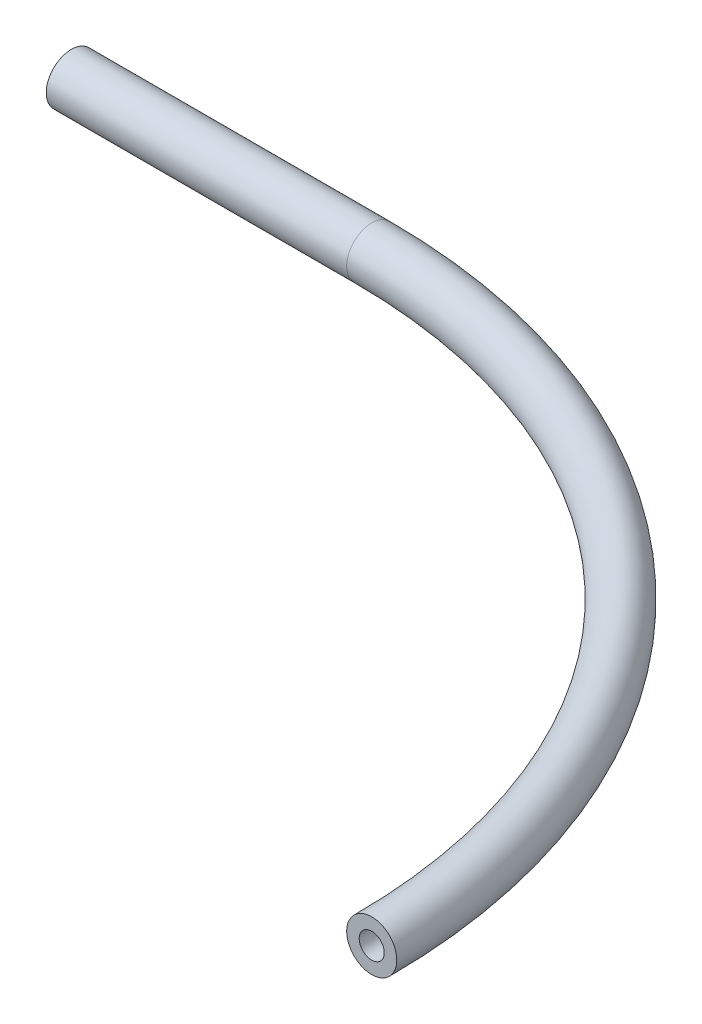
ISO-10303-21;
HEADER;
FILE_DESCRIPTION(('STEP AP214'),'2;1');
FILE_NAME('part.step','',(''),(''),'','','');
FILE_SCHEMA(('AUTOMOTIVE_DESIGN { 1 0 10303 214 1 1 1 1 }'));
ENDSEC;
DATA;
#1=APPLICATION_CONTEXT('core data for automotive mechanical design processes');
#2=APPLICATION_PROTOCOL_DEFINITION('international standard','automotive_design',2000,#1);
#3=PRODUCT_CONTEXT('',#1,'mechanical');
#4=PRODUCT('Part','Part','',(#3));
#5=PRODUCT_RELATED_PRODUCT_CATEGORY('part','',(#4));
#6=PRODUCT_DEFINITION_FORMATION('','',#4);
#7=PRODUCT_DEFINITION_CONTEXT('part definition',#1,'design');
#8=PRODUCT_DEFINITION('design','',#6,#7);
#9=PRODUCT_DEFINITION_SHAPE('','',#8);
#10=(LENGTH_UNIT() NAMED_UNIT(*) SI_UNIT(.MILLI.,.METRE.));
#11=(NAMED_UNIT(*) PLANE_ANGLE_UNIT() SI_UNIT($,.RADIAN.));
#12=(NAMED_UNIT(*) SI_UNIT($,.STERADIAN.) SOLID_ANGLE_UNIT());
#13=UNCERTAINTY_MEASURE_WITH_UNIT(LENGTH_MEASURE(1.E-05),#10,'distance_accuracy_value','');
#14=(GEOMETRIC_REPRESENTATION_CONTEXT(3) GLOBAL_UNCERTAINTY_ASSIGNED_CONTEXT((#13)) GLOBAL_UNIT_ASSIGNED_CONTEXT((#10,
#11,#12)) REPRESENTATION_CONTEXT('',''));
#15=CARTESIAN_POINT('',(0.,0.,0.));
#16=DIRECTION('',(0.,0.,1.));
#17=DIRECTION('',(1.,0.,0.));
#18=AXIS2_PLACEMENT_3D('',#15,#16,#17);
#19=CARTESIAN_POINT('',(19.05,0.,38.1));
#20=DIRECTION('',(0.,-1.,0.));
#21=DIRECTION('',(0.,0.,-1.));
#22=AXIS2_PLACEMENT_3D('',#19,#20,#21);
#23=TOROIDAL_SURFACE('',#22,38.1,1.5875);
#24=CARTESIAN_POINT('',(19.05,0.,0.));
#25=DIRECTION('',(1.,0.,0.));
#26=DIRECTION('',(0.,0.,-1.));
#27=AXIS2_PLACEMENT_3D('',#24,#25,#26);
#28=CIRCLE('',#27,1.5875);
#29=CARTESIAN_POINT('',(19.05,0.,-1.58749999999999));
#30=VERTEX_POINT('',#29);
#31=EDGE_CURVE('E40',#30,#30,#28,.T.);
#32=CARTESIAN_POINT('',(57.15,0.,38.1));
#33=DIRECTION('',(0.,0.,1.));
#34=DIRECTION('',(1.,0.,0.));
#35=AXIS2_PLACEMENT_3D('',#32,#33,#34);
#36=CIRCLE('',#35,1.5875);
#37=CARTESIAN_POINT('',(58.7375,0.,38.1));
#38=VERTEX_POINT('',#37);
#39=EDGE_CURVE('E10',#38,#38,#36,.T.);
#40=CARTESIAN_POINT('',(19.05,0.,38.1));
#41=DIRECTION('',(0.,-1.,0.));
#42=DIRECTION('',(0.,0.,-1.));
#43=AXIS2_PLACEMENT_3D('',#40,#41,#42);
#44=CIRCLE('',#43,39.6875);
#45=EDGE_CURVE('',#30,#38,#44,.T.);
#46=ORIENTED_EDGE('',*,*,#31,.T.);
#47=ORIENTED_EDGE('',*,*,#39,.F.);
#48=ORIENTED_EDGE('',*,*,#45,.T.);
#49=ORIENTED_EDGE('',*,*,#45,.F.);
#50=EDGE_LOOP('',(#46,#48,#47,#49));
#51=FACE_BOUND('',#50,.T.);
#52=ADVANCED_FACE('F30',(#51),#23,.T.);
#53=CARTESIAN_POINT('',(19.05,0.,38.1));
#54=DIRECTION('',(0.,-1.,0.));
#55=DIRECTION('',(0.,0.,-1.));
#56=AXIS2_PLACEMENT_3D('',#53,#54,#55);
#57=TOROIDAL_SURFACE('',#56,38.1,0.79375);
#58=CARTESIAN_POINT('',(19.05,0.,0.));
#59=DIRECTION('',(1.,0.,0.));
#60=DIRECTION('',(0.,0.,-1.));
#61=AXIS2_PLACEMENT_3D('',#58,#59,#60);
#62=CIRCLE('',#61,0.79375);
#63=CARTESIAN_POINT('',(19.05,0.,-0.793749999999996));
#64=VERTEX_POINT('',#63);
#65=EDGE_CURVE('E44',#64,#64,#62,.T.);
#66=CARTESIAN_POINT('',(57.15,0.,38.1));
#67=DIRECTION('',(0.,0.,1.));
#68=DIRECTION('',(1.,0.,0.));
#69=AXIS2_PLACEMENT_3D('',#66,#67,#68);
#70=CIRCLE('',#69,0.79375);
#71=CARTESIAN_POINT('',(57.94375,0.,38.1));
#72=VERTEX_POINT('',#71);
#73=EDGE_CURVE('E36',#72,#72,#70,.T.);
#74=CARTESIAN_POINT('',(19.05,0.,38.1));
#75=DIRECTION('',(0.,-1.,0.));
#76=DIRECTION('',(0.,0.,-1.));
#77=AXIS2_PLACEMENT_3D('',#74,#75,#76);
#78=CIRCLE('',#77,38.89375);
#79=EDGE_CURVE('',#64,#72,#78,.T.);
#80=ORIENTED_EDGE('',*,*,#65,.F.);
#81=ORIENTED_EDGE('',*,*,#73,.T.);
#82=ORIENTED_EDGE('',*,*,#79,.T.);
#83=ORIENTED_EDGE('',*,*,#79,.F.);
#84=EDGE_LOOP('',(#80,#82,#81,#83));
#85=FACE_BOUND('',#84,.T.);
#86=ADVANCED_FACE('F59',(#85),#57,.F.);
#87=CARTESIAN_POINT('',(19.05,0.,0.));
#88=DIRECTION('',(-1.,0.,0.));
#89=DIRECTION('',(0.,0.,1.));
#90=AXIS2_PLACEMENT_3D('',#87,#88,#89);
#91=CYLINDRICAL_SURFACE('',#90,0.79375);
#92=ORIENTED_EDGE('',*,*,#65,.T.);
#93=EDGE_LOOP('',(#92));
#94=FACE_BOUND('',#93,.T.);
#95=CARTESIAN_POINT('',(0.,0.,0.));
#96=DIRECTION('',(1.,0.,0.));
#97=DIRECTION('',(0.,0.,-1.));
#98=AXIS2_PLACEMENT_3D('',#95,#96,#97);
#99=CIRCLE('',#98,0.79375);
#100=CARTESIAN_POINT('',(0.,0.,-0.79375));
#101=VERTEX_POINT('',#100);
#102=EDGE_CURVE('E50',#101,#101,#99,.T.);
#103=ORIENTED_EDGE('',*,*,#102,.F.);
#104=EDGE_LOOP('',(#103));
#105=FACE_BOUND('',#104,.T.);
#106=ADVANCED_FACE('F56',(#94,#105),#91,.F.);
#107=CARTESIAN_POINT('',(19.05,0.,0.));
#108=DIRECTION('',(-1.,0.,0.));
#109=DIRECTION('',(0.,0.,1.));
#110=AXIS2_PLACEMENT_3D('',#107,#108,#109);
#111=CYLINDRICAL_SURFACE('',#110,1.5875);
#112=ORIENTED_EDGE('',*,*,#31,.F.);
#113=EDGE_LOOP('',(#112));
#114=FACE_BOUND('',#113,.T.);
#115=CARTESIAN_POINT('',(0.,0.,0.));
#116=DIRECTION('',(1.,0.,0.));
#117=DIRECTION('',(0.,0.,-1.));
#118=AXIS2_PLACEMENT_3D('',#115,#116,#117);
#119=CIRCLE('',#118,1.5875);
#120=CARTESIAN_POINT('',(0.,0.,-1.5875));
#121=VERTEX_POINT('',#120);
#122=EDGE_CURVE('E47',#121,#121,#119,.T.);
#123=ORIENTED_EDGE('',*,*,#122,.T.);
#124=EDGE_LOOP('',(#123));
#125=FACE_BOUND('',#124,.T.);
#126=ADVANCED_FACE('F65',(#114,#125),#111,.T.);
#127=CARTESIAN_POINT('',(57.15,0.,38.1));
#128=DIRECTION('',(0.,0.,1.));
#129=DIRECTION('',(1.,0.,0.));
#130=AXIS2_PLACEMENT_3D('',#127,#128,#129);
#131=PLANE('',#130);
#132=ORIENTED_EDGE('',*,*,#73,.F.);
#133=EDGE_LOOP('',(#132));
#134=FACE_BOUND('',#133,.T.);
#135=ORIENTED_EDGE('',*,*,#39,.T.);
#136=EDGE_LOOP('',(#135));
#137=FACE_BOUND('',#136,.T.);
#138=ADVANCED_FACE('F71',(#134,#137),#131,.T.);
#139=CARTESIAN_POINT('',(0.,0.,0.));
#140=DIRECTION('',(1.,0.,0.));
#141=DIRECTION('',(0.,0.,-1.));
#142=AXIS2_PLACEMENT_3D('',#139,#140,#141);
#143=PLANE('',#142);
#144=ORIENTED_EDGE('',*,*,#102,.T.);
#145=EDGE_LOOP('',(#144));
#146=FACE_BOUND('',#145,.T.);
#147=ORIENTED_EDGE('',*,*,#122,.F.);
#148=EDGE_LOOP('',(#147));
#149=FACE_BOUND('',#148,.T.);
#150=ADVANCED_FACE('F73',(#146,#149),#143,.F.);
#151=CLOSED_SHELL('',(#52,#86,#106,#126,#138,#150));
#152=MANIFOLD_SOLID_BREP('B2',#151);
#153=ADVANCED_BREP_SHAPE_REPRESENTATION('',(#18,#152),#14);
#154=SHAPE_DEFINITION_REPRESENTATION(#9,#153);
ENDSEC;
END-ISO-10303-21;
